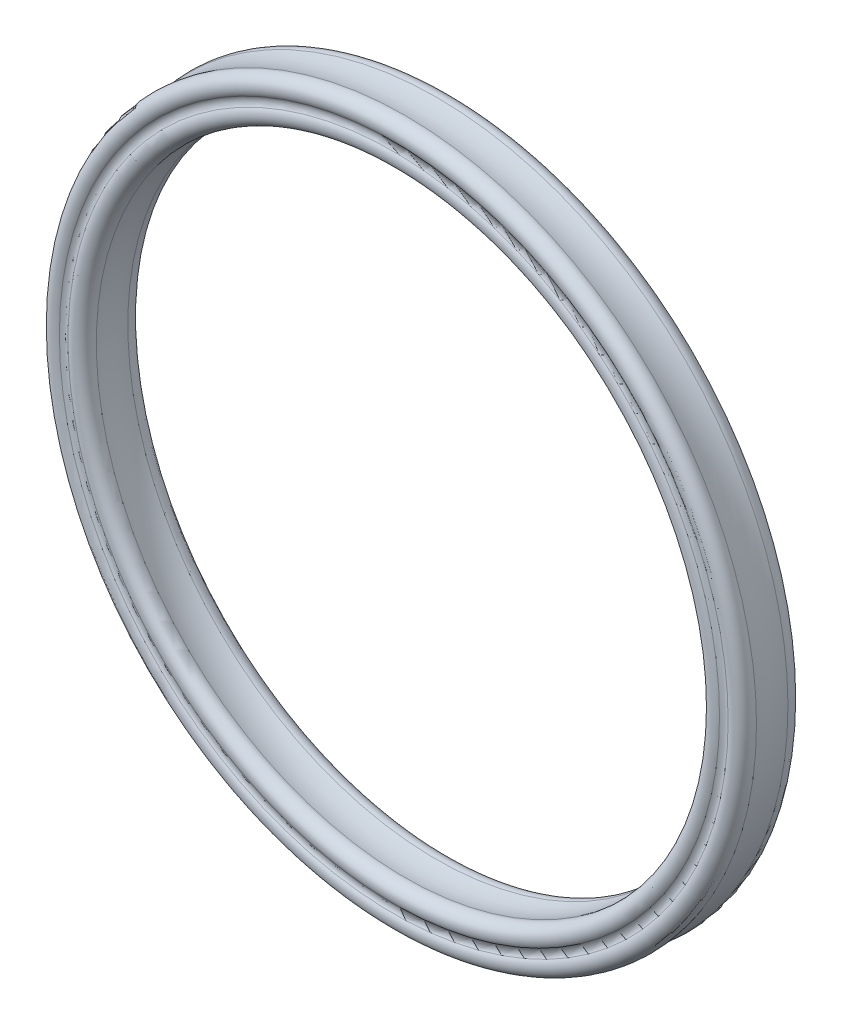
ISO-10303-21;
HEADER;
FILE_DESCRIPTION(('STEP AP214'),'2;1');
FILE_NAME('part.step','',(''),(''),'','','');
FILE_SCHEMA(('AUTOMOTIVE_DESIGN { 1 0 10303 214 1 1 1 1 }'));
ENDSEC;
DATA;
#1=APPLICATION_CONTEXT('core data for automotive mechanical design processes');
#2=APPLICATION_PROTOCOL_DEFINITION('international standard','automotive_design',2000,#1);
#3=PRODUCT_CONTEXT('',#1,'mechanical');
#4=PRODUCT('Part','Part','',(#3));
#5=PRODUCT_RELATED_PRODUCT_CATEGORY('part','',(#4));
#6=PRODUCT_DEFINITION_FORMATION('','',#4);
#7=PRODUCT_DEFINITION_CONTEXT('part definition',#1,'design');
#8=PRODUCT_DEFINITION('design','',#6,#7);
#9=PRODUCT_DEFINITION_SHAPE('','',#8);
#10=(LENGTH_UNIT() NAMED_UNIT(*) SI_UNIT(.MILLI.,.METRE.));
#11=(NAMED_UNIT(*) PLANE_ANGLE_UNIT() SI_UNIT($,.RADIAN.));
#12=(NAMED_UNIT(*) SI_UNIT($,.STERADIAN.) SOLID_ANGLE_UNIT());
#13=UNCERTAINTY_MEASURE_WITH_UNIT(LENGTH_MEASURE(1.E-05),#10,'distance_accuracy_value','');
#14=(GEOMETRIC_REPRESENTATION_CONTEXT(3) GLOBAL_UNCERTAINTY_ASSIGNED_CONTEXT((#13)) GLOBAL_UNIT_ASSIGNED_CONTEXT((#10,
#11,#12)) REPRESENTATION_CONTEXT('',''));
#15=CARTESIAN_POINT('',(0.,0.,0.));
#16=DIRECTION('',(0.,0.,1.));
#17=DIRECTION('',(1.,0.,0.));
#18=AXIS2_PLACEMENT_3D('',#15,#16,#17);
#19=CARTESIAN_POINT('',(0.,0.,0.366666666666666));
#20=DIRECTION('',(0.,0.,1.));
#21=DIRECTION('',(1.,0.,0.));
#22=AXIS2_PLACEMENT_3D('',#19,#20,#21);
#23=TOROIDAL_SURFACE('',#22,33.7,0.733333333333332);
#24=CARTESIAN_POINT('',(0.,0.,-0.22));
#25=DIRECTION('',(0.,0.,1.));
#26=DIRECTION('',(1.,0.,0.));
#27=AXIS2_PLACEMENT_3D('',#24,#25,#26);
#28=CIRCLE('',#27,33.26);
#29=CARTESIAN_POINT('',(33.26,0.,-0.22));
#30=VERTEX_POINT('',#29);
#31=EDGE_CURVE('E10',#30,#30,#28,.T.);
#32=ORIENTED_EDGE('',*,*,#31,.F.);
#33=EDGE_LOOP('',(#32));
#34=FACE_BOUND('',#33,.T.);
#35=CARTESIAN_POINT('',(0.,0.,-0.220000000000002));
#36=DIRECTION('',(0.,0.,1.));
#37=DIRECTION('',(1.,0.,0.));
#38=AXIS2_PLACEMENT_3D('',#35,#36,#37);
#39=CIRCLE('',#38,34.14);
#40=CARTESIAN_POINT('',(34.14,0.,-0.220000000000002));
#41=VERTEX_POINT('',#40);
#42=EDGE_CURVE('E57',#41,#41,#39,.T.);
#43=ORIENTED_EDGE('',*,*,#42,.T.);
#44=EDGE_LOOP('',(#43));
#45=FACE_BOUND('',#44,.T.);
#46=ADVANCED_FACE('F29',(#34,#45),#23,.F.);
#47=CARTESIAN_POINT('',(0.,0.,-1.1));
#48=DIRECTION('',(0.,0.,1.));
#49=DIRECTION('',(1.,0.,0.));
#50=AXIS2_PLACEMENT_3D('',#47,#48,#49);
#51=TOROIDAL_SURFACE('',#50,32.6,1.1);
#52=CARTESIAN_POINT('',(0.,0.,-1.3943661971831));
#53=DIRECTION('',(0.,0.,1.));
#54=DIRECTION('',(1.,0.,0.));
#55=AXIS2_PLACEMENT_3D('',#52,#53,#54);
#56=CIRCLE('',#55,31.5401186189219);
#57=CARTESIAN_POINT('',(31.5401186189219,0.,-1.3943661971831));
#58=VERTEX_POINT('',#57);
#59=EDGE_CURVE('E35',#58,#58,#56,.T.);
#60=ORIENTED_EDGE('',*,*,#59,.F.);
#61=EDGE_LOOP('',(#60));
#62=FACE_BOUND('',#61,.T.);
#63=ORIENTED_EDGE('',*,*,#31,.T.);
#64=EDGE_LOOP('',(#63));
#65=FACE_BOUND('',#64,.T.);
#66=ADVANCED_FACE('F94',(#62,#65),#51,.T.);
#67=CARTESIAN_POINT('',(0.,0.,-3.));
#68=DIRECTION('',(0.,0.,1.));
#69=DIRECTION('',(1.,0.,0.));
#70=AXIS2_PLACEMENT_3D('',#67,#68,#69);
#71=TOROIDAL_SURFACE('',#70,25.7589474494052,6.);
#72=CARTESIAN_POINT('',(0.,0.,-4.6056338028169));
#73=DIRECTION('',(0.,0.,1.));
#74=DIRECTION('',(1.,0.,0.));
#75=AXIS2_PLACEMENT_3D('',#72,#73,#74);
#76=CIRCLE('',#75,31.5401186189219);
#77=CARTESIAN_POINT('',(31.5401186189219,0.,-4.6056338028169));
#78=VERTEX_POINT('',#77);
#79=EDGE_CURVE('E39',#78,#78,#76,.T.);
#80=ORIENTED_EDGE('',*,*,#79,.F.);
#81=EDGE_LOOP('',(#80));
#82=FACE_BOUND('',#81,.T.);
#83=ORIENTED_EDGE('',*,*,#59,.T.);
#84=EDGE_LOOP('',(#83));
#85=FACE_BOUND('',#84,.T.);
#86=ADVANCED_FACE('F89',(#82,#85),#71,.F.);
#87=CARTESIAN_POINT('',(0.,0.,-4.9));
#88=DIRECTION('',(0.,0.,1.));
#89=DIRECTION('',(1.,0.,0.));
#90=AXIS2_PLACEMENT_3D('',#87,#88,#89);
#91=TOROIDAL_SURFACE('',#90,32.6,1.1);
#92=CARTESIAN_POINT('',(0.,0.,-5.78));
#93=DIRECTION('',(0.,0.,1.));
#94=DIRECTION('',(1.,0.,0.));
#95=AXIS2_PLACEMENT_3D('',#92,#93,#94);
#96=CIRCLE('',#95,33.26);
#97=CARTESIAN_POINT('',(33.26,0.,-5.78));
#98=VERTEX_POINT('',#97);
#99=EDGE_CURVE('E43',#98,#98,#96,.T.);
#100=ORIENTED_EDGE('',*,*,#99,.F.);
#101=EDGE_LOOP('',(#100));
#102=FACE_BOUND('',#101,.T.);
#103=ORIENTED_EDGE('',*,*,#79,.T.);
#104=EDGE_LOOP('',(#103));
#105=FACE_BOUND('',#104,.T.);
#106=ADVANCED_FACE('F83',(#102,#105),#91,.T.);
#107=CARTESIAN_POINT('',(0.,0.,-6.36666666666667));
#108=DIRECTION('',(0.,0.,1.));
#109=DIRECTION('',(1.,0.,0.));
#110=AXIS2_PLACEMENT_3D('',#107,#108,#109);
#111=TOROIDAL_SURFACE('',#110,33.7,0.733333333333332);
#112=CARTESIAN_POINT('',(0.,0.,-5.78));
#113=DIRECTION('',(0.,0.,1.));
#114=DIRECTION('',(1.,0.,0.));
#115=AXIS2_PLACEMENT_3D('',#112,#113,#114);
#116=CIRCLE('',#115,34.14);
#117=CARTESIAN_POINT('',(34.14,0.,-5.78));
#118=VERTEX_POINT('',#117);
#119=EDGE_CURVE('E48',#118,#118,#116,.T.);
#120=ORIENTED_EDGE('',*,*,#119,.F.);
#121=EDGE_LOOP('',(#120));
#122=FACE_BOUND('',#121,.T.);
#123=ORIENTED_EDGE('',*,*,#99,.T.);
#124=EDGE_LOOP('',(#123));
#125=FACE_BOUND('',#124,.T.);
#126=ADVANCED_FACE('F77',(#122,#125),#111,.F.);
#127=CARTESIAN_POINT('',(0.,0.,-4.9));
#128=DIRECTION('',(0.,0.,1.));
#129=DIRECTION('',(1.,0.,0.));
#130=AXIS2_PLACEMENT_3D('',#127,#128,#129);
#131=TOROIDAL_SURFACE('',#130,34.8,1.1);
#132=CARTESIAN_POINT('',(0.,0.,-4.6056338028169));
#133=DIRECTION('',(0.,0.,1.));
#134=DIRECTION('',(1.,0.,0.));
#135=AXIS2_PLACEMENT_3D('',#132,#133,#134);
#136=CIRCLE('',#135,35.8598813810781);
#137=CARTESIAN_POINT('',(35.8598813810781,0.,-4.6056338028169));
#138=VERTEX_POINT('',#137);
#139=EDGE_CURVE('E51',#138,#138,#136,.T.);
#140=ORIENTED_EDGE('',*,*,#139,.F.);
#141=EDGE_LOOP('',(#140));
#142=FACE_BOUND('',#141,.T.);
#143=ORIENTED_EDGE('',*,*,#119,.T.);
#144=EDGE_LOOP('',(#143));
#145=FACE_BOUND('',#144,.T.);
#146=ADVANCED_FACE('F71',(#142,#145),#131,.T.);
#147=CARTESIAN_POINT('',(0.,0.,-3.));
#148=DIRECTION('',(0.,0.,1.));
#149=DIRECTION('',(1.,0.,0.));
#150=AXIS2_PLACEMENT_3D('',#147,#148,#149);
#151=TOROIDAL_SURFACE('',#150,41.6410525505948,6.);
#152=CARTESIAN_POINT('',(0.,0.,-1.3943661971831));
#153=DIRECTION('',(0.,0.,1.));
#154=DIRECTION('',(1.,0.,0.));
#155=AXIS2_PLACEMENT_3D('',#152,#153,#154);
#156=CIRCLE('',#155,35.8598813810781);
#157=CARTESIAN_POINT('',(35.8598813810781,0.,-1.3943661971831));
#158=VERTEX_POINT('',#157);
#159=EDGE_CURVE('E54',#158,#158,#156,.T.);
#160=ORIENTED_EDGE('',*,*,#159,.F.);
#161=EDGE_LOOP('',(#160));
#162=FACE_BOUND('',#161,.T.);
#163=ORIENTED_EDGE('',*,*,#139,.T.);
#164=EDGE_LOOP('',(#163));
#165=FACE_BOUND('',#164,.T.);
#166=ADVANCED_FACE('F65',(#162,#165),#151,.F.);
#167=CARTESIAN_POINT('',(0.,0.,-1.1));
#168=DIRECTION('',(0.,0.,1.));
#169=DIRECTION('',(1.,0.,0.));
#170=AXIS2_PLACEMENT_3D('',#167,#168,#169);
#171=TOROIDAL_SURFACE('',#170,34.8,1.1);
#172=ORIENTED_EDGE('',*,*,#42,.F.);
#173=EDGE_LOOP('',(#172));
#174=FACE_BOUND('',#173,.T.);
#175=ORIENTED_EDGE('',*,*,#159,.T.);
#176=EDGE_LOOP('',(#175));
#177=FACE_BOUND('',#176,.T.);
#178=ADVANCED_FACE('F62',(#174,#177),#171,.T.);
#179=CLOSED_SHELL('',(#46,#66,#86,#106,#126,#146,#166,#178));
#180=MANIFOLD_SOLID_BREP('B2',#179);
#181=ADVANCED_BREP_SHAPE_REPRESENTATION('',(#18,#180),#14);
#182=SHAPE_DEFINITION_REPRESENTATION(#9,#181);
ENDSEC;
END-ISO-10303-21;
